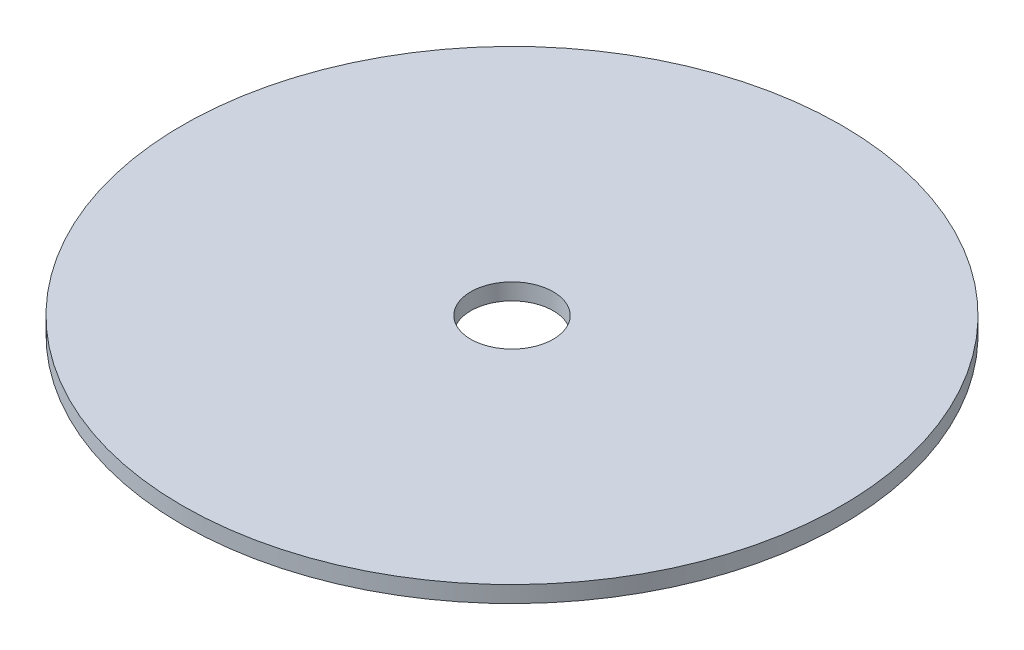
ISO-10303-21;
HEADER;
FILE_DESCRIPTION(('STEP AP214'),'2;1');
FILE_NAME('part.step','',(''),(''),'','','');
FILE_SCHEMA(('AUTOMOTIVE_DESIGN { 1 0 10303 214 1 1 1 1 }'));
ENDSEC;
DATA;
#1=APPLICATION_CONTEXT('core data for automotive mechanical design processes');
#2=APPLICATION_PROTOCOL_DEFINITION('international standard','automotive_design',2000,#1);
#3=PRODUCT_CONTEXT('',#1,'mechanical');
#4=PRODUCT('Part','Part','',(#3));
#5=PRODUCT_RELATED_PRODUCT_CATEGORY('part','',(#4));
#6=PRODUCT_DEFINITION_FORMATION('','',#4);
#7=PRODUCT_DEFINITION_CONTEXT('part definition',#1,'design');
#8=PRODUCT_DEFINITION('design','',#6,#7);
#9=PRODUCT_DEFINITION_SHAPE('','',#8);
#10=(LENGTH_UNIT() NAMED_UNIT(*) SI_UNIT(.MILLI.,.METRE.));
#11=(NAMED_UNIT(*) PLANE_ANGLE_UNIT() SI_UNIT($,.RADIAN.));
#12=(NAMED_UNIT(*) SI_UNIT($,.STERADIAN.) SOLID_ANGLE_UNIT());
#13=UNCERTAINTY_MEASURE_WITH_UNIT(LENGTH_MEASURE(1.E-05),#10,'distance_accuracy_value','');
#14=(GEOMETRIC_REPRESENTATION_CONTEXT(3) GLOBAL_UNCERTAINTY_ASSIGNED_CONTEXT((#13)) GLOBAL_UNIT_ASSIGNED_CONTEXT((#10,
#11,#12)) REPRESENTATION_CONTEXT('',''));
#15=CARTESIAN_POINT('',(0.,0.,0.));
#16=DIRECTION('',(0.,0.,1.));
#17=DIRECTION('',(1.,0.,0.));
#18=AXIS2_PLACEMENT_3D('',#15,#16,#17);
#19=CARTESIAN_POINT('',(0.,2.,0.));
#20=DIRECTION('',(0.,1.,0.));
#21=DIRECTION('',(0.,0.,1.));
#22=AXIS2_PLACEMENT_3D('',#19,#20,#21);
#23=PLANE('',#22);
#24=CARTESIAN_POINT('',(0.,2.,0.));
#25=DIRECTION('',(0.,1.,0.));
#26=DIRECTION('',(0.,0.,1.));
#27=AXIS2_PLACEMENT_3D('',#24,#25,#26);
#28=CIRCLE('',#27,40.);
#29=CARTESIAN_POINT('',(0.,2.,40.));
#30=VERTEX_POINT('',#29);
#31=EDGE_CURVE('E10',#30,#30,#28,.T.);
#32=ORIENTED_EDGE('',*,*,#31,.T.);
#33=EDGE_LOOP('',(#32));
#34=FACE_BOUND('',#33,.T.);
#35=CARTESIAN_POINT('',(0.,2.,0.));
#36=DIRECTION('',(0.,1.,0.));
#37=DIRECTION('',(0.,0.,1.));
#38=AXIS2_PLACEMENT_3D('',#35,#36,#37);
#39=CIRCLE('',#38,5.);
#40=CARTESIAN_POINT('',(0.,2.,5.));
#41=VERTEX_POINT('',#40);
#42=EDGE_CURVE('E42',#41,#41,#39,.T.);
#43=ORIENTED_EDGE('',*,*,#42,.F.);
#44=EDGE_LOOP('',(#43));
#45=FACE_BOUND('',#44,.T.);
#46=ADVANCED_FACE('F31',(#34,#45),#23,.T.);
#47=CARTESIAN_POINT('',(0.,0.,0.));
#48=DIRECTION('',(0.,1.,0.));
#49=DIRECTION('',(0.,0.,1.));
#50=AXIS2_PLACEMENT_3D('',#47,#48,#49);
#51=PLANE('',#50);
#52=CARTESIAN_POINT('',(0.,0.,0.));
#53=DIRECTION('',(0.,1.,0.));
#54=DIRECTION('',(0.,0.,1.));
#55=AXIS2_PLACEMENT_3D('',#52,#53,#54);
#56=CIRCLE('',#55,40.);
#57=CARTESIAN_POINT('',(0.,0.,40.));
#58=VERTEX_POINT('',#57);
#59=EDGE_CURVE('E35',#58,#58,#56,.T.);
#60=ORIENTED_EDGE('',*,*,#59,.F.);
#61=EDGE_LOOP('',(#60));
#62=FACE_BOUND('',#61,.T.);
#63=CARTESIAN_POINT('',(0.,0.,0.));
#64=DIRECTION('',(0.,1.,0.));
#65=DIRECTION('',(0.,0.,1.));
#66=AXIS2_PLACEMENT_3D('',#63,#64,#65);
#67=CIRCLE('',#66,5.);
#68=CARTESIAN_POINT('',(0.,0.,5.));
#69=VERTEX_POINT('',#68);
#70=EDGE_CURVE('E44',#69,#69,#67,.T.);
#71=ORIENTED_EDGE('',*,*,#70,.T.);
#72=EDGE_LOOP('',(#71));
#73=FACE_BOUND('',#72,.T.);
#74=ADVANCED_FACE('F54',(#62,#73),#51,.F.);
#75=CARTESIAN_POINT('',(0.,2.,0.));
#76=DIRECTION('',(0.,-1.,0.));
#77=DIRECTION('',(0.,0.,-1.));
#78=AXIS2_PLACEMENT_3D('',#75,#76,#77);
#79=CYLINDRICAL_SURFACE('',#78,40.);
#80=ORIENTED_EDGE('',*,*,#31,.F.);
#81=EDGE_LOOP('',(#80));
#82=FACE_BOUND('',#81,.T.);
#83=ORIENTED_EDGE('',*,*,#59,.T.);
#84=EDGE_LOOP('',(#83));
#85=FACE_BOUND('',#84,.T.);
#86=ADVANCED_FACE('F33',(#82,#85),#79,.T.);
#87=CARTESIAN_POINT('',(0.,2.,0.));
#88=DIRECTION('',(0.,-1.,0.));
#89=DIRECTION('',(0.,0.,-1.));
#90=AXIS2_PLACEMENT_3D('',#87,#88,#89);
#91=CYLINDRICAL_SURFACE('',#90,5.);
#92=ORIENTED_EDGE('',*,*,#42,.T.);
#93=EDGE_LOOP('',(#92));
#94=FACE_BOUND('',#93,.T.);
#95=ORIENTED_EDGE('',*,*,#70,.F.);
#96=EDGE_LOOP('',(#95));
#97=FACE_BOUND('',#96,.T.);
#98=ADVANCED_FACE('F50',(#94,#97),#91,.F.);
#99=CLOSED_SHELL('',(#46,#74,#86,#98));
#100=MANIFOLD_SOLID_BREP('B2',#99);
#101=ADVANCED_BREP_SHAPE_REPRESENTATION('',(#18,#100),#14);
#102=SHAPE_DEFINITION_REPRESENTATION(#9,#101);
ENDSEC;
END-ISO-10303-21;
